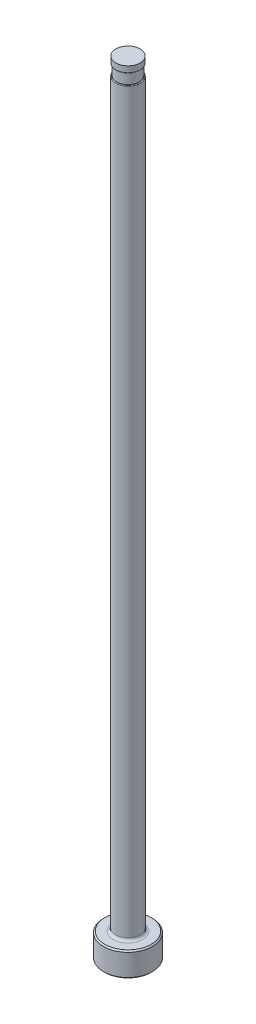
ISO-10303-21;
HEADER;
FILE_DESCRIPTION(('STEP AP214'),'2;1');
FILE_NAME('part.step','',(''),(''),'','','');
FILE_SCHEMA(('AUTOMOTIVE_DESIGN { 1 0 10303 214 1 1 1 1 }'));
ENDSEC;
DATA;
#1=APPLICATION_CONTEXT('core data for automotive mechanical design processes');
#2=APPLICATION_PROTOCOL_DEFINITION('international standard','automotive_design',2000,#1);
#3=PRODUCT_CONTEXT('',#1,'mechanical');
#4=PRODUCT('Part','Part','',(#3));
#5=PRODUCT_RELATED_PRODUCT_CATEGORY('part','',(#4));
#6=PRODUCT_DEFINITION_FORMATION('','',#4);
#7=PRODUCT_DEFINITION_CONTEXT('part definition',#1,'design');
#8=PRODUCT_DEFINITION('design','',#6,#7);
#9=PRODUCT_DEFINITION_SHAPE('','',#8);
#10=(LENGTH_UNIT() NAMED_UNIT(*) SI_UNIT(.MILLI.,.METRE.));
#11=(NAMED_UNIT(*) PLANE_ANGLE_UNIT() SI_UNIT($,.RADIAN.));
#12=(NAMED_UNIT(*) SI_UNIT($,.STERADIAN.) SOLID_ANGLE_UNIT());
#13=UNCERTAINTY_MEASURE_WITH_UNIT(LENGTH_MEASURE(1.E-05),#10,'distance_accuracy_value','');
#14=(GEOMETRIC_REPRESENTATION_CONTEXT(3) GLOBAL_UNCERTAINTY_ASSIGNED_CONTEXT((#13)) GLOBAL_UNIT_ASSIGNED_CONTEXT((#10,
#11,#12)) REPRESENTATION_CONTEXT('',''));
#15=CARTESIAN_POINT('',(0.,0.,0.));
#16=DIRECTION('',(0.,0.,1.));
#17=DIRECTION('',(1.,0.,0.));
#18=AXIS2_PLACEMENT_3D('',#15,#16,#17);
#19=CARTESIAN_POINT('',(-2.38124999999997,151.13,0.));
#20=DIRECTION('',(0.,1.,0.));
#21=DIRECTION('',(0.,0.,1.));
#22=AXIS2_PLACEMENT_3D('',#19,#20,#21);
#23=PLANE('',#22);
#24=CARTESIAN_POINT('',(0.,151.13,0.));
#25=DIRECTION('',(0.,1.,0.));
#26=DIRECTION('',(0.,0.,1.));
#27=AXIS2_PLACEMENT_3D('',#24,#25,#26);
#28=CIRCLE('',#27,2.24154999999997);
#29=CARTESIAN_POINT('',(0.,151.13,2.24154999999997));
#30=VERTEX_POINT('',#29);
#31=EDGE_CURVE('E11',#30,#30,#28,.F.);
#32=ORIENTED_EDGE('',*,*,#31,.T.);
#33=EDGE_LOOP('',(#32));
#34=FACE_BOUND('',#33,.T.);
#35=CARTESIAN_POINT('',(0.,151.13,0.));
#36=DIRECTION('',(0.,1.,0.));
#37=DIRECTION('',(0.,0.,1.));
#38=AXIS2_PLACEMENT_3D('',#35,#36,#37);
#39=CIRCLE('',#38,2.17804999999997);
#40=CARTESIAN_POINT('',(0.,151.13,2.17804999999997));
#41=VERTEX_POINT('',#40);
#42=EDGE_CURVE('E78',#41,#41,#39,.T.);
#43=ORIENTED_EDGE('',*,*,#42,.T.);
#44=EDGE_LOOP('',(#43));
#45=FACE_BOUND('',#44,.T.);
#46=ADVANCED_FACE('F36',(#34,#45),#23,.F.);
#47=CARTESIAN_POINT('',(0.,259.958771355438,0.));
#48=DIRECTION('',(0.,1.,0.));
#49=DIRECTION('',(0.,0.,1.));
#50=AXIS2_PLACEMENT_3D('',#47,#48,#49);
#51=CYLINDRICAL_SURFACE('',#50,2.38124999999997);
#52=DIRECTION('',(0.,1.,0.));
#53=VECTOR('',#52,1.);
#54=CARTESIAN_POINT('',(-2.17804999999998,259.958771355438,-0.962522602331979));
#55=LINE('',#54,#53);
#56=CARTESIAN_POINT('',(-2.17804999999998,148.971,-0.962522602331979));
#57=VERTEX_POINT('',#56);
#58=CARTESIAN_POINT('',(-2.17804999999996,86.614,-0.962522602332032));
#59=VERTEX_POINT('',#58);
#60=EDGE_CURVE('E73',#57,#59,#55,.F.);
#61=ORIENTED_EDGE('',*,*,#60,.F.);
#62=CARTESIAN_POINT('',(0.,148.971,0.));
#63=DIRECTION('',(0.,-1.,0.));
#64=DIRECTION('',(0.,0.,-1.));
#65=AXIS2_PLACEMENT_3D('',#62,#63,#64);
#66=CIRCLE('',#65,2.38124999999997);
#67=CARTESIAN_POINT('',(-2.17804999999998,148.971,0.962522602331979));
#68=VERTEX_POINT('',#67);
#69=EDGE_CURVE('E51',#57,#68,#66,.T.);
#70=ORIENTED_EDGE('',*,*,#69,.T.);
#71=DIRECTION('',(0.,1.,0.));
#72=VECTOR('',#71,1.);
#73=CARTESIAN_POINT('',(-2.17804999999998,259.958771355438,0.962522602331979));
#74=LINE('',#73,#72);
#75=CARTESIAN_POINT('',(-2.17804999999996,86.614,0.962522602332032));
#76=VERTEX_POINT('',#75);
#77=EDGE_CURVE('E84',#76,#68,#74,.T.);
#78=ORIENTED_EDGE('',*,*,#77,.F.);
#79=CARTESIAN_POINT('',(-2.17804999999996,86.614,-0.962522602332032));
#80=CARTESIAN_POINT('',(-2.17804780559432,86.5795018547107,-0.962518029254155));
#81=CARTESIAN_POINT('',(-2.17861298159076,86.545018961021,-0.961249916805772));
#82=CARTESIAN_POINT('',(-2.18085247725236,86.4762686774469,-0.956161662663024));
#83=CARTESIAN_POINT('',(-2.18252711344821,86.4420013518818,-0.952340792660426));
#84=CARTESIAN_POINT('',(-2.1891933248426,86.3395683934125,-0.936973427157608));
#85=CARTESIAN_POINT('',(-2.19582685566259,86.2720398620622,-0.921521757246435));
#86=CARTESIAN_POINT('',(-2.21282724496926,86.1406839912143,-0.879915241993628));
#87=CARTESIAN_POINT('',(-2.22320261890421,86.0768654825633,-0.853735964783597));
#88=CARTESIAN_POINT('',(-2.24648169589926,85.955467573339,-0.790444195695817));
#89=CARTESIAN_POINT('',(-2.25938069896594,85.8978768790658,-0.753351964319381));
#90=CARTESIAN_POINT('',(-2.28491232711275,85.795635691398,-0.671716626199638));
#91=CARTESIAN_POINT('',(-2.29748627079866,85.7503240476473,-0.627987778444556));
#92=CARTESIAN_POINT('',(-2.32155764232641,85.6692931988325,-0.532115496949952));
#93=CARTESIAN_POINT('',(-2.33305607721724,85.6335649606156,-0.479980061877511));
#94=CARTESIAN_POINT('',(-2.35169958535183,85.5780195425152,-0.377071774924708));
#95=CARTESIAN_POINT('',(-2.35923505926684,85.5566414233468,-0.32721006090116));
#96=CARTESIAN_POINT('',(-2.37124673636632,85.5232228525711,-0.224104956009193));
#97=CARTESIAN_POINT('',(-2.37572523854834,85.5111753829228,-0.170864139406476));
#98=CARTESIAN_POINT('',(-2.38075337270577,85.4977017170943,-0.0686114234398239));
#99=CARTESIAN_POINT('',(-2.38166713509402,85.4952904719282,-0.0197447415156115));
#100=CARTESIAN_POINT('',(-2.38048039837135,85.4984469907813,0.0776854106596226));
#101=CARTESIAN_POINT('',(-2.37838078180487,85.5040124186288,0.126248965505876));
#102=CARTESIAN_POINT('',(-2.37150634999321,85.5226178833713,0.220133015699));
#103=CARTESIAN_POINT('',(-2.36681675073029,85.5354201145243,0.265507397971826));
#104=CARTESIAN_POINT('',(-2.35529269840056,85.5678782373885,0.353434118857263));
#105=CARTESIAN_POINT('',(-2.34845810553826,85.5875345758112,0.395986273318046));
#106=CARTESIAN_POINT('',(-2.33302551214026,85.6338518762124,0.478724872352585));
#107=CARTESIAN_POINT('',(-2.32437464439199,85.6607318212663,0.518778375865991));
#108=CARTESIAN_POINT('',(-2.30627307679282,85.720276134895,0.594104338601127));
#109=CARTESIAN_POINT('',(-2.29682214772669,85.7529421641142,0.629375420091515));
#110=CARTESIAN_POINT('',(-2.2770553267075,85.826313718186,0.697674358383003));
#111=CARTESIAN_POINT('',(-2.26673904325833,85.8674804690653,0.730205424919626));
#112=CARTESIAN_POINT('',(-2.24701006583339,85.9543579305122,0.788832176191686));
#113=CARTESIAN_POINT('',(-2.23759789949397,86.0000712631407,0.814924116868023));
#114=CARTESIAN_POINT('',(-2.2192874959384,86.1010502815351,0.863643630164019));
#115=CARTESIAN_POINT('',(-2.21061480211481,86.156785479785,0.885381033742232));
#116=CARTESIAN_POINT('',(-2.1960946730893,86.2711026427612,0.920807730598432));
#117=CARTESIAN_POINT('',(-2.19024759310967,86.3296849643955,0.934496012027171));
#118=CARTESIAN_POINT('',(-2.18339215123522,86.4261545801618,0.950364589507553));
#119=CARTESIAN_POINT('',(-2.18139223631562,86.4636004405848,0.954933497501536));
#120=CARTESIAN_POINT('',(-2.17872026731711,86.5386947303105,0.961006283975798));
#121=CARTESIAN_POINT('',(-2.1780449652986,86.5763424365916,0.962517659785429));
#122=CARTESIAN_POINT('',(-2.17804999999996,86.614,0.962522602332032));
#123=B_SPLINE_CURVE_WITH_KNOTS('',3,(#79,#80,#81,#82,#83,#84,#85,#86,#87,#88,#89,#90,#91,#92,
#93,#94,#95,#96,#97,#98,#99,#100,#101,#102,#103,#104,#105,#106,#107,#108,#109,#110,#111,#112,
#113,#114,#115,#116,#117,#118,#119,#120,#121,#122),.UNSPECIFIED.,.F.,.F.,(4,2,2,2,2,2,2,2,2,2,2,
2,2,2,2,2,2,2,2,2,2,4),(0.,0.103435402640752,0.206900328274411,0.414624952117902,
0.622825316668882,0.830641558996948,1.02213180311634,1.21344091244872,1.37683606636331,
1.54010820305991,1.68618349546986,1.83221601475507,1.97370762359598,2.11520845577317,
2.26160909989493,2.40805183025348,2.56783060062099,2.72770205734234,2.90833881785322,
3.08899828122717,3.2021919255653,3.31510767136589),.UNSPECIFIED.);
#124=EDGE_CURVE('E81',#59,#76,#123,.T.);
#125=ORIENTED_EDGE('',*,*,#124,.F.);
#126=EDGE_LOOP('',(#61,#70,#78,#125));
#127=FACE_BOUND('',#126,.T.);
#128=CARTESIAN_POINT('',(0.,5.25779999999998,0.));
#129=DIRECTION('',(0.,1.,0.));
#130=DIRECTION('',(0.,0.,1.));
#131=AXIS2_PLACEMENT_3D('',#128,#129,#130);
#132=CIRCLE('',#131,2.38124999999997);
#133=CARTESIAN_POINT('',(0.,5.25779999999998,2.38124999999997));
#134=VERTEX_POINT('',#133);
#135=EDGE_CURVE('E116',#134,#134,#132,.T.);
#136=ORIENTED_EDGE('',*,*,#135,.T.);
#137=EDGE_LOOP('',(#136));
#138=FACE_BOUND('',#137,.T.);
#139=ADVANCED_FACE('F82',(#127,#138),#51,.T.);
#140=CARTESIAN_POINT('',(0.,0.,0.));
#141=DIRECTION('',(0.,-1.,0.));
#142=DIRECTION('',(0.,0.,-1.));
#143=AXIS2_PLACEMENT_3D('',#140,#141,#142);
#144=PLANE('',#143);
#145=CARTESIAN_POINT('',(0.,0.,0.));
#146=DIRECTION('',(0.,-1.,0.));
#147=DIRECTION('',(0.,0.,-1.));
#148=AXIS2_PLACEMENT_3D('',#145,#146,#147);
#149=CIRCLE('',#148,4.50849999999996);
#150=CARTESIAN_POINT('',(0.,0.,-4.50849999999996));
#151=VERTEX_POINT('',#150);
#152=EDGE_CURVE('E113',#151,#151,#149,.T.);
#153=ORIENTED_EDGE('',*,*,#152,.T.);
#154=EDGE_LOOP('',(#153));
#155=FACE_BOUND('',#154,.T.);
#156=ADVANCED_FACE('F192',(#155),#144,.T.);
#157=CARTESIAN_POINT('',(0.,259.958771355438,0.));
#158=DIRECTION('',(0.,1.,0.));
#159=DIRECTION('',(0.,0.,1.));
#160=AXIS2_PLACEMENT_3D('',#157,#158,#159);
#161=CYLINDRICAL_SURFACE('',#160,4.76249999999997);
#162=CARTESIAN_POINT('',(0.,4.49579999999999,0.));
#163=DIRECTION('',(0.,1.,0.));
#164=DIRECTION('',(0.,0.,1.));
#165=AXIS2_PLACEMENT_3D('',#162,#163,#164);
#166=CIRCLE('',#165,4.76249999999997);
#167=CARTESIAN_POINT('',(0.,4.49579999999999,4.76249999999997));
#168=VERTEX_POINT('',#167);
#169=EDGE_CURVE('E110',#168,#168,#166,.F.);
#170=ORIENTED_EDGE('',*,*,#169,.T.);
#171=EDGE_LOOP('',(#170));
#172=FACE_BOUND('',#171,.T.);
#173=CARTESIAN_POINT('',(0.,0.254000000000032,0.));
#174=DIRECTION('',(0.,-1.,0.));
#175=DIRECTION('',(0.,0.,-1.));
#176=AXIS2_PLACEMENT_3D('',#173,#174,#175);
#177=CIRCLE('',#176,4.76249999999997);
#178=CARTESIAN_POINT('',(0.,0.254000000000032,-4.76249999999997));
#179=VERTEX_POINT('',#178);
#180=EDGE_CURVE('E107',#179,#179,#177,.F.);
#181=ORIENTED_EDGE('',*,*,#180,.T.);
#182=EDGE_LOOP('',(#181));
#183=FACE_BOUND('',#182,.T.);
#184=ADVANCED_FACE('F195',(#172,#183),#161,.T.);
#185=CARTESIAN_POINT('',(-4.76249999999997,4.7498,0.));
#186=DIRECTION('',(0.,1.,0.));
#187=DIRECTION('',(0.,0.,1.));
#188=AXIS2_PLACEMENT_3D('',#185,#186,#187);
#189=PLANE('',#188);
#190=CARTESIAN_POINT('',(0.,4.7498,0.));
#191=DIRECTION('',(0.,1.,0.));
#192=DIRECTION('',(0.,0.,1.));
#193=AXIS2_PLACEMENT_3D('',#190,#191,#192);
#194=CIRCLE('',#193,2.88924999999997);
#195=CARTESIAN_POINT('',(0.,4.7498,2.88924999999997));
#196=VERTEX_POINT('',#195);
#197=EDGE_CURVE('E87',#196,#196,#194,.F.);
#198=ORIENTED_EDGE('',*,*,#197,.T.);
#199=EDGE_LOOP('',(#198));
#200=FACE_BOUND('',#199,.T.);
#201=CARTESIAN_POINT('',(0.,4.7498,0.));
#202=DIRECTION('',(0.,1.,0.));
#203=DIRECTION('',(0.,0.,1.));
#204=AXIS2_PLACEMENT_3D('',#201,#202,#203);
#205=CIRCLE('',#204,4.50849999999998);
#206=CARTESIAN_POINT('',(0.,4.7498,4.50849999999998));
#207=VERTEX_POINT('',#206);
#208=EDGE_CURVE('E104',#207,#207,#205,.T.);
#209=ORIENTED_EDGE('',*,*,#208,.T.);
#210=EDGE_LOOP('',(#209));
#211=FACE_BOUND('',#210,.T.);
#212=ADVANCED_FACE('F190',(#200,#211),#189,.T.);
#213=CARTESIAN_POINT('',(0.,4.74980000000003,0.));
#214=DIRECTION('',(0.,-1.,0.));
#215=DIRECTION('',(0.,0.,-1.));
#216=AXIS2_PLACEMENT_3D('',#213,#214,#215);
#217=CONICAL_SURFACE('',#216,4.50849999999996,0.785398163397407);
#218=ORIENTED_EDGE('',*,*,#169,.F.);
#219=EDGE_LOOP('',(#218));
#220=FACE_BOUND('',#219,.T.);
#221=ORIENTED_EDGE('',*,*,#208,.F.);
#222=EDGE_LOOP('',(#221));
#223=FACE_BOUND('',#222,.T.);
#224=ADVANCED_FACE('F186',(#220,#223),#217,.T.);
#225=CARTESIAN_POINT('',(0.,0.254000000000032,0.));
#226=DIRECTION('',(0.,1.,0.));
#227=DIRECTION('',(0.,0.,1.));
#228=AXIS2_PLACEMENT_3D('',#225,#226,#227);
#229=CONICAL_SURFACE('',#228,4.76249999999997,0.785398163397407);
#230=ORIENTED_EDGE('',*,*,#152,.F.);
#231=EDGE_LOOP('',(#230));
#232=FACE_BOUND('',#231,.T.);
#233=ORIENTED_EDGE('',*,*,#180,.F.);
#234=EDGE_LOOP('',(#233));
#235=FACE_BOUND('',#234,.T.);
#236=ADVANCED_FACE('F182',(#232,#235),#229,.T.);
#237=CARTESIAN_POINT('',(0.,5.25779999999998,0.));
#238=DIRECTION('',(0.,1.,0.));
#239=DIRECTION('',(0.,0.,1.));
#240=AXIS2_PLACEMENT_3D('',#237,#238,#239);
#241=TOROIDAL_SURFACE('',#240,2.88924999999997,0.508);
#242=ORIENTED_EDGE('',*,*,#197,.F.);
#243=EDGE_LOOP('',(#242));
#244=FACE_BOUND('',#243,.T.);
#245=ORIENTED_EDGE('',*,*,#135,.F.);
#246=EDGE_LOOP('',(#245));
#247=FACE_BOUND('',#246,.T.);
#248=ADVANCED_FACE('F147',(#244,#247),#241,.F.);
#249=CARTESIAN_POINT('',(-2.38124999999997,149.098,0.));
#250=DIRECTION('',(0.,-1.,0.));
#251=DIRECTION('',(0.,0.,-1.));
#252=AXIS2_PLACEMENT_3D('',#249,#250,#251);
#253=PLANE('',#252);
#254=DIRECTION('',(0.,0.,1.));
#255=VECTOR('',#254,1.);
#256=CARTESIAN_POINT('',(-2.17804999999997,149.098,0.));
#257=LINE('',#256,#255);
#258=CARTESIAN_POINT('',(-2.17804999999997,149.098,0.));
#259=VERTEX_POINT('',#258);
#260=CARTESIAN_POINT('',(-2.17804999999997,149.098,0.581155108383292));
#261=VERTEX_POINT('',#260);
#262=EDGE_CURVE('E90',#259,#261,#257,.T.);
#263=ORIENTED_EDGE('',*,*,#262,.T.);
#264=CARTESIAN_POINT('',(0.,149.098,0.));
#265=DIRECTION('',(0.,-1.,0.));
#266=DIRECTION('',(0.,0.,-1.));
#267=AXIS2_PLACEMENT_3D('',#264,#265,#266);
#268=CIRCLE('',#267,2.25424999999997);
#269=CARTESIAN_POINT('',(-2.17804999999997,149.098,-0.581155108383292));
#270=VERTEX_POINT('',#269);
#271=EDGE_CURVE('E86',#261,#270,#268,.F.);
#272=ORIENTED_EDGE('',*,*,#271,.T.);
#273=EDGE_CURVE('E79',#270,#259,#257,.T.);
#274=ORIENTED_EDGE('',*,*,#273,.T.);
#275=CARTESIAN_POINT('',(0.,149.098,0.));
#276=DIRECTION('',(0.,1.,0.));
#277=DIRECTION('',(0.,0.,1.));
#278=AXIS2_PLACEMENT_3D('',#275,#276,#277);
#279=CIRCLE('',#278,2.17804999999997);
#280=EDGE_CURVE('E101',#259,#259,#279,.T.);
#281=ORIENTED_EDGE('',*,*,#280,.F.);
#282=EDGE_LOOP('',(#263,#272,#274,#281));
#283=FACE_BOUND('',#282,.T.);
#284=ADVANCED_FACE('F144',(#283),#253,.F.);
#285=CARTESIAN_POINT('',(0.,153.448281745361,0.));
#286=DIRECTION('',(0.,1.,0.));
#287=DIRECTION('',(0.,0.,1.));
#288=AXIS2_PLACEMENT_3D('',#285,#286,#287);
#289=CYLINDRICAL_SURFACE('',#288,2.17804999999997);
#290=ORIENTED_EDGE('',*,*,#42,.F.);
#291=EDGE_LOOP('',(#290));
#292=FACE_BOUND('',#291,.T.);
#293=ORIENTED_EDGE('',*,*,#280,.T.);
#294=EDGE_LOOP('',(#293));
#295=FACE_BOUND('',#294,.T.);
#296=ADVANCED_FACE('F141',(#292,#295),#289,.T.);
#297=CARTESIAN_POINT('',(-2.17804999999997,150.114,-4.76249999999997));
#298=DIRECTION('',(1.,0.,0.));
#299=DIRECTION('',(0.,1.,0.));
#300=AXIS2_PLACEMENT_3D('',#297,#298,#299);
#301=PLANE('',#300);
#302=ORIENTED_EDGE('',*,*,#273,.F.);
#303=CARTESIAN_POINT('',(-2.17804999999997,149.098,-0.581155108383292));
#304=CARTESIAN_POINT('',(-2.17804999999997,149.097983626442,-0.602476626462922));
#305=CARTESIAN_POINT('',(-2.17804999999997,149.097640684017,-0.623812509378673));
#306=CARTESIAN_POINT('',(-2.17804999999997,149.095977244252,-0.66657666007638));
#307=CARTESIAN_POINT('',(-2.17804999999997,149.094650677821,-0.688004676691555));
#308=CARTESIAN_POINT('',(-2.17804999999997,149.090700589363,-0.730611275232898));
#309=CARTESIAN_POINT('',(-2.17804999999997,149.088085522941,-0.751790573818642));
#310=CARTESIAN_POINT('',(-2.17804999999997,149.081057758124,-0.793813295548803));
#311=CARTESIAN_POINT('',(-2.17804999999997,149.07664941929,-0.814657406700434));
#312=CARTESIAN_POINT('',(-2.17804999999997,149.066237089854,-0.851716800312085));
#313=CARTESIAN_POINT('',(-2.17804999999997,149.060702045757,-0.868052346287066));
#314=CARTESIAN_POINT('',(-2.17804999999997,149.049132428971,-0.894514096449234));
#315=CARTESIAN_POINT('',(-2.17804999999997,149.043824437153,-0.9049545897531));
#316=CARTESIAN_POINT('',(-2.17804999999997,149.031415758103,-0.92469921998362));
#317=CARTESIAN_POINT('',(-2.17804999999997,149.02433515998,-0.934014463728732));
#318=CARTESIAN_POINT('',(-2.17804999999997,149.013229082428,-0.944592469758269));
#319=CARTESIAN_POINT('',(-2.17804999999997,149.010360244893,-0.9470514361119));
#320=CARTESIAN_POINT('',(-2.17804999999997,149.004314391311,-0.951571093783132));
#321=CARTESIAN_POINT('',(-2.17804999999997,149.001137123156,-0.953631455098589));
#322=CARTESIAN_POINT('',(-2.17804999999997,148.994434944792,-0.95723424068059));
#323=CARTESIAN_POINT('',(-2.17804999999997,148.990905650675,-0.958768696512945));
#324=CARTESIAN_POINT('',(-2.17804999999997,148.983614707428,-0.961099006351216));
#325=CARTESIAN_POINT('',(-2.17804999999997,148.979854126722,-0.961898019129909));
#326=CARTESIAN_POINT('',(-2.17804999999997,148.975218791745,-0.962356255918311));
#327=CARTESIAN_POINT('',(-2.17804999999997,148.974376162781,-0.962418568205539));
#328=CARTESIAN_POINT('',(-2.17804999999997,148.972689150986,-0.96250166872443));
#329=CARTESIAN_POINT('',(-2.17804999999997,148.971844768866,-0.962522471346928));
#330=CARTESIAN_POINT('',(-2.17804999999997,148.971,-0.962522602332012));
#331=B_SPLINE_CURVE_WITH_KNOTS('',3,(#303,#304,#305,#306,#307,#308,#309,#310,#311,#312,#313,
#314,#315,#316,#317,#318,#319,#320,#321,#322,#323,#324,#325,#326,#327,#328,#329,#330),
.UNSPECIFIED.,.F.,.F.,(4,2,2,2,2,2,2,2,2,2,2,2,2,4),(0.,0.063984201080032,0.12836651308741,
0.192331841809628,0.256142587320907,0.307700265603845,0.342760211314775,0.377439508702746,
0.388748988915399,0.400067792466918,0.411551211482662,0.422985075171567,0.4255192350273,
0.42805251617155),.UNSPECIFIED.);
#332=EDGE_CURVE('E59',#270,#57,#331,.T.);
#333=ORIENTED_EDGE('',*,*,#332,.T.);
#334=ORIENTED_EDGE('',*,*,#60,.T.);
#335=DIRECTION('',(0.,0.,1.));
#336=VECTOR('',#335,1.);
#337=CARTESIAN_POINT('',(-2.17804999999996,86.614,-4.76249999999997));
#338=LINE('',#337,#336);
#339=EDGE_CURVE('E77',#59,#76,#338,.T.);
#340=ORIENTED_EDGE('',*,*,#339,.T.);
#341=ORIENTED_EDGE('',*,*,#77,.T.);
#342=CARTESIAN_POINT('',(-2.17804999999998,148.971,0.962522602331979));
#343=CARTESIAN_POINT('',(-2.17804999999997,148.974186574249,0.962531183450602));
#344=CARTESIAN_POINT('',(-2.17804999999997,148.977361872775,0.962226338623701));
#345=CARTESIAN_POINT('',(-2.17804999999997,148.983573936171,0.961069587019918));
#346=CARTESIAN_POINT('',(-2.17804999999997,148.986611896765,0.960224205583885));
#347=CARTESIAN_POINT('',(-2.17804999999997,148.993208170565,0.957808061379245));
#348=CARTESIAN_POINT('',(-2.17804999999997,148.996720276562,0.956113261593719));
#349=CARTESIAN_POINT('',(-2.17804999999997,149.003436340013,0.952177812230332));
#350=CARTESIAN_POINT('',(-2.17804999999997,149.006638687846,0.949934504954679));
#351=CARTESIAN_POINT('',(-2.17804999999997,149.014556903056,0.943588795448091));
#352=CARTESIAN_POINT('',(-2.17804999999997,149.019024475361,0.939179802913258));
#353=CARTESIAN_POINT('',(-2.17804999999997,149.027265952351,0.92976646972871));
#354=CARTESIAN_POINT('',(-2.17804999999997,149.031038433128,0.924760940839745));
#355=CARTESIAN_POINT('',(-2.17804999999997,149.041602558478,0.90908064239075));
#356=CARTESIAN_POINT('',(-2.17804999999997,149.047541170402,0.897838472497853));
#357=CARTESIAN_POINT('',(-2.17804999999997,149.057910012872,0.874691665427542));
#358=CARTESIAN_POINT('',(-2.17804999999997,149.062335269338,0.862784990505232));
#359=CARTESIAN_POINT('',(-2.17804999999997,149.072383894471,0.831512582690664));
#360=CARTESIAN_POINT('',(-2.17804999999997,149.077178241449,0.811883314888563));
#361=CARTESIAN_POINT('',(-2.17804999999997,149.08496264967,0.772260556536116));
#362=CARTESIAN_POINT('',(-2.17804999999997,149.08794845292,0.752266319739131));
#363=CARTESIAN_POINT('',(-2.17804999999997,149.094978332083,0.691996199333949));
#364=CARTESIAN_POINT('',(-2.17804999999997,149.097079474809,0.651494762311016));
#365=CARTESIAN_POINT('',(-2.17804999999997,149.097838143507,0.606044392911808));
#366=CARTESIAN_POINT('',(-2.17804999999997,149.097899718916,0.601059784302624));
#367=CARTESIAN_POINT('',(-2.17804999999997,149.097980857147,0.591102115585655));
#368=CARTESIAN_POINT('',(-2.17804999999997,149.098000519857,0.586129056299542));
#369=CARTESIAN_POINT('',(-2.17804999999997,149.098,0.581155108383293));
#370=B_SPLINE_CURVE_WITH_KNOTS('',3,(#342,#343,#344,#345,#346,#347,#348,#349,#350,#351,#352,
#353,#354,#355,#356,#357,#358,#359,#360,#361,#362,#363,#364,#365,#366,#367,#368,#369),
.UNSPECIFIED.,.F.,.F.,(4,2,2,2,2,2,2,2,2,2,2,2,2,4),(0.,0.00952696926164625,0.0189410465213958,
0.0305748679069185,0.042266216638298,0.0609902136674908,0.0797521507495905,0.117682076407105,
0.155735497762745,0.216197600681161,0.276801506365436,0.398198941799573,0.413154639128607,
0.428074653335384),.UNSPECIFIED.);
#371=EDGE_CURVE('E172',#68,#261,#370,.T.);
#372=ORIENTED_EDGE('',*,*,#371,.T.);
#373=ORIENTED_EDGE('',*,*,#262,.F.);
#374=EDGE_LOOP('',(#302,#333,#334,#340,#341,#372,#373));
#375=FACE_BOUND('',#374,.T.);
#376=ADVANCED_FACE('F75',(#375),#301,.F.);
#377=CARTESIAN_POINT('',(-5.35304999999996,86.614,-4.76249999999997));
#378=DIRECTION('',(0.,0.,1.));
#379=DIRECTION('',(1.,0.,0.));
#380=AXIS2_PLACEMENT_3D('',#377,#378,#379);
#381=CYLINDRICAL_SURFACE('',#380,3.175);
#382=ORIENTED_EDGE('',*,*,#339,.F.);
#383=ORIENTED_EDGE('',*,*,#124,.T.);
#384=EDGE_LOOP('',(#382,#383));
#385=FACE_BOUND('',#384,.T.);
#386=ADVANCED_FACE('F89',(#385),#381,.F.);
#387=CARTESIAN_POINT('',(0.,152.687735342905,0.));
#388=DIRECTION('',(0.,1.,0.));
#389=DIRECTION('',(0.,0.,1.));
#390=AXIS2_PLACEMENT_3D('',#387,#388,#389);
#391=CYLINDRICAL_SURFACE('',#390,2.36854999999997);
#392=CARTESIAN_POINT('',(0.,151.257,0.));
#393=DIRECTION('',(0.,1.,0.));
#394=DIRECTION('',(0.,0.,1.));
#395=AXIS2_PLACEMENT_3D('',#392,#393,#394);
#396=CIRCLE('',#395,2.36854999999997);
#397=CARTESIAN_POINT('',(0.,151.257,2.36854999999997));
#398=VERTEX_POINT('',#397);
#399=EDGE_CURVE('E44',#398,#398,#396,.T.);
#400=ORIENTED_EDGE('',*,*,#399,.T.);
#401=EDGE_LOOP('',(#400));
#402=FACE_BOUND('',#401,.T.);
#403=CARTESIAN_POINT('',(0.,152.4,0.));
#404=DIRECTION('',(0.,1.,0.));
#405=DIRECTION('',(0.,0.,1.));
#406=AXIS2_PLACEMENT_3D('',#403,#404,#405);
#407=CIRCLE('',#406,2.36854999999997);
#408=CARTESIAN_POINT('',(0.,152.4,2.36854999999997));
#409=VERTEX_POINT('',#408);
#410=EDGE_CURVE('E91',#409,#409,#407,.T.);
#411=ORIENTED_EDGE('',*,*,#410,.F.);
#412=EDGE_LOOP('',(#411));
#413=FACE_BOUND('',#412,.T.);
#414=ADVANCED_FACE('F135',(#402,#413),#391,.T.);
#415=CARTESIAN_POINT('',(-2.38124999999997,152.4,0.));
#416=DIRECTION('',(0.,1.,0.));
#417=DIRECTION('',(0.,0.,1.));
#418=AXIS2_PLACEMENT_3D('',#415,#416,#417);
#419=PLANE('',#418);
#420=ORIENTED_EDGE('',*,*,#410,.T.);
#421=EDGE_LOOP('',(#420));
#422=FACE_BOUND('',#421,.T.);
#423=ADVANCED_FACE('F149',(#422),#419,.T.);
#424=CARTESIAN_POINT('',(0.,148.971,0.));
#425=DIRECTION('',(0.,-1.,0.));
#426=DIRECTION('',(0.,0.,-1.));
#427=AXIS2_PLACEMENT_3D('',#424,#425,#426);
#428=TOROIDAL_SURFACE('',#427,2.25424999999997,0.127);
#429=ORIENTED_EDGE('',*,*,#371,.F.);
#430=ORIENTED_EDGE('',*,*,#69,.F.);
#431=ORIENTED_EDGE('',*,*,#332,.F.);
#432=ORIENTED_EDGE('',*,*,#271,.F.);
#433=EDGE_LOOP('',(#429,#430,#431,#432));
#434=FACE_BOUND('',#433,.T.);
#435=ADVANCED_FACE('F151',(#434),#428,.T.);
#436=CARTESIAN_POINT('',(0.,151.257,0.));
#437=DIRECTION('',(0.,1.,0.));
#438=DIRECTION('',(0.,0.,1.));
#439=AXIS2_PLACEMENT_3D('',#436,#437,#438);
#440=TOROIDAL_SURFACE('',#439,2.24154999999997,0.127);
#441=ORIENTED_EDGE('',*,*,#31,.F.);
#442=EDGE_LOOP('',(#441));
#443=FACE_BOUND('',#442,.T.);
#444=ORIENTED_EDGE('',*,*,#399,.F.);
#445=EDGE_LOOP('',(#444));
#446=FACE_BOUND('',#445,.T.);
#447=ADVANCED_FACE('F38',(#443,#446),#440,.T.);
#448=CLOSED_SHELL('',(#46,#139,#156,#184,#212,#224,#236,#248,#284,#296,#376,#386,#414,#423,#435,#447));
#449=MANIFOLD_SOLID_BREP('B2',#448);
#450=ADVANCED_BREP_SHAPE_REPRESENTATION('',(#18,#449),#14);
#451=SHAPE_DEFINITION_REPRESENTATION(#9,#450);
ENDSEC;
END-ISO-10303-21;
